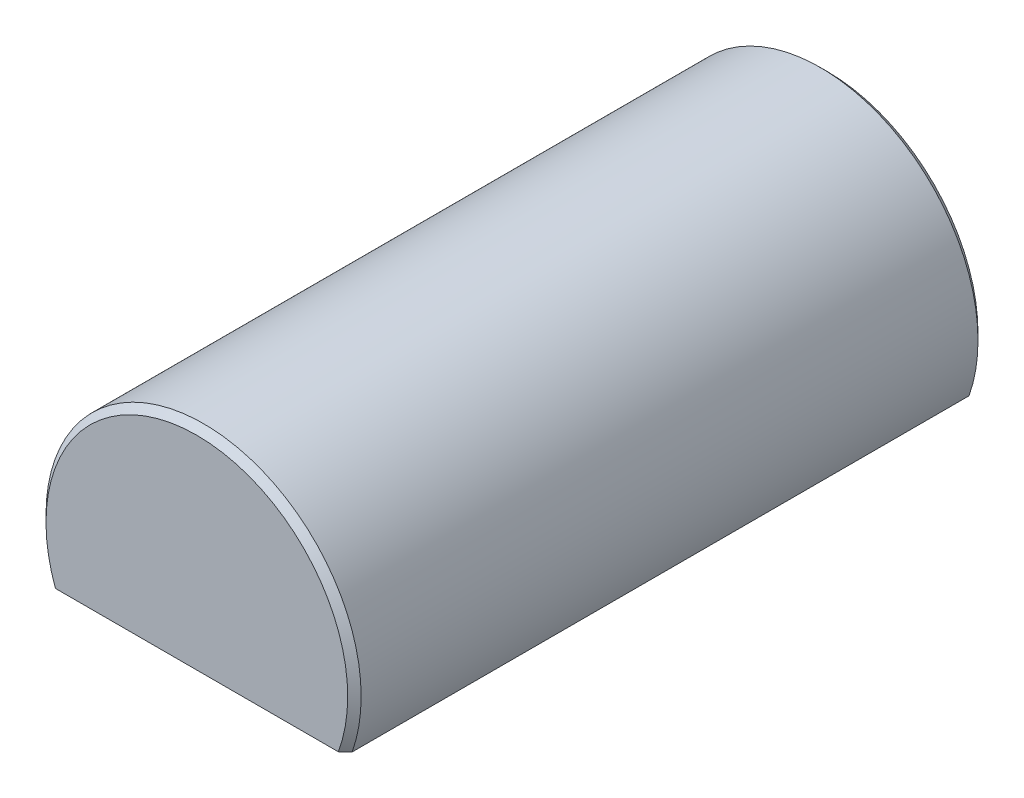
from build123d import *

# Parameters (mm, degrees)
SKETCH1_R            = 9.525
EXTRUDE1_DEPTH       = 19.05
CHAMFER1_SIZE        = 0.4064
TRUNCATED_DEPTH      = 24.3313898
TRUNCATED_DEPTH_BACK = 24.3313898
SKETCH6_R            = 2.38125
BLIND_HOLES_DEPTH    = 4.7625


with BuildPart() as part:
    # Sketch1 → Extrude1 (new, symmetric)
    with BuildSketch(Plane.XY):
        with Locations(Location((0, 0, 0), (0, 0, 180))):
            Circle(SKETCH1_R)
    extrude(amount=EXTRUDE1_DEPTH, both=True)

    # Chamfer1
    chamfer1_edges = [part.edges().sort_by_distance(p)[0] for p in [
        (9.525, 0, -19.05),
        (9.525, 0, 19.05),
    ]]
    chamfer(chamfer1_edges, length=CHAMFER1_SIZE)

    # Sketch2 → Truncated (cut, two sides: drawn at the far end of the back side and taken through both)
    with BuildSketch(Plane.XY.offset(-TRUNCATED_DEPTH_BACK)):
        with BuildLine():
            Line((-8.980256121, -3.175), (8.980256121, -3.175))
            ThreePointArc((8.980256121, -3.175), (0, -9.525), (-8.980256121, -3.175))
        make_face()
    extrude(amount=TRUNCATED_DEPTH + TRUNCATED_DEPTH_BACK, mode=Mode.SUBTRACT)

    # Sketch6 → Blind Holes (cut)
    with BuildSketch(Plane(origin=(0, -3.175, 0), x_dir=(-1, 0, 0), z_dir=(0, 1, 0))):
        with Locations(Location((0, 12.7, 0), (0, 0, 270))):
            Circle(SKETCH6_R)
        with Locations(Location((0, -12.7, 0), (0, 0, 270))):
            Circle(SKETCH6_R)
    extrude(amount=BLIND_HOLES_DEPTH, mode=Mode.SUBTRACT)


solid = part.part
